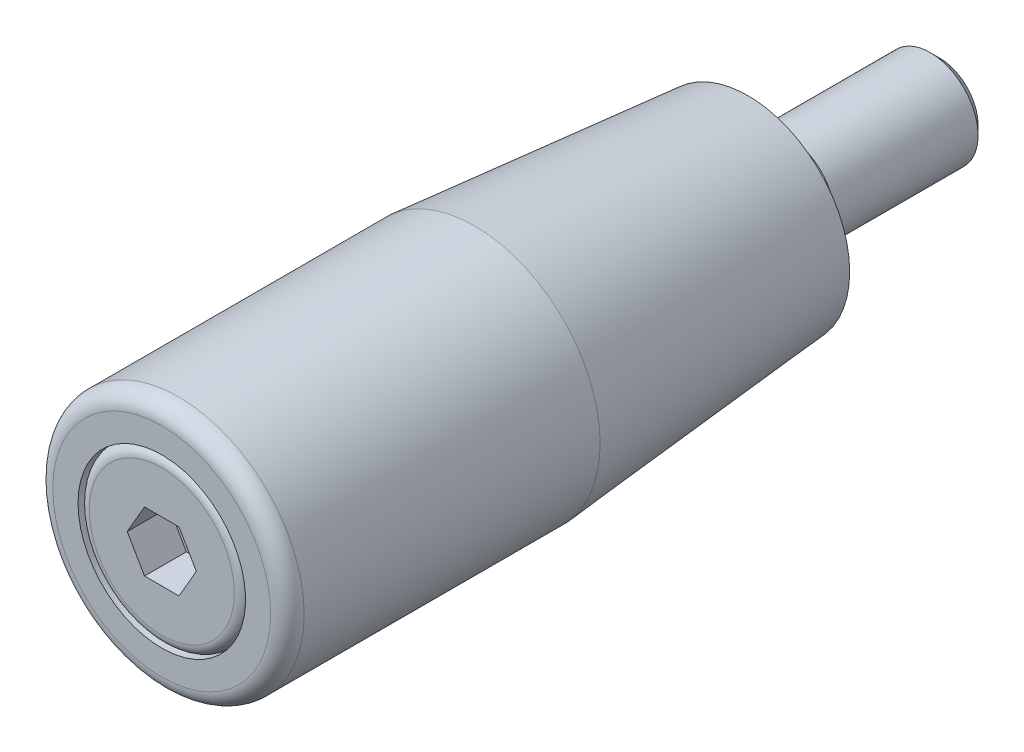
ISO-10303-21;
HEADER;
FILE_DESCRIPTION(('STEP AP214'),'2;1');
FILE_NAME('part.step','',(''),(''),'','','');
FILE_SCHEMA(('AUTOMOTIVE_DESIGN { 1 0 10303 214 1 1 1 1 }'));
ENDSEC;
DATA;
#1=APPLICATION_CONTEXT('core data for automotive mechanical design processes');
#2=APPLICATION_PROTOCOL_DEFINITION('international standard','automotive_design',2000,#1);
#3=PRODUCT_CONTEXT('',#1,'mechanical');
#4=PRODUCT('Part','Part','',(#3));
#5=PRODUCT_RELATED_PRODUCT_CATEGORY('part','',(#4));
#6=PRODUCT_DEFINITION_FORMATION('','',#4);
#7=PRODUCT_DEFINITION_CONTEXT('part definition',#1,'design');
#8=PRODUCT_DEFINITION('design','',#6,#7);
#9=PRODUCT_DEFINITION_SHAPE('','',#8);
#10=(LENGTH_UNIT() NAMED_UNIT(*) SI_UNIT(.MILLI.,.METRE.));
#11=(NAMED_UNIT(*) PLANE_ANGLE_UNIT() SI_UNIT($,.RADIAN.));
#12=(NAMED_UNIT(*) SI_UNIT($,.STERADIAN.) SOLID_ANGLE_UNIT());
#13=UNCERTAINTY_MEASURE_WITH_UNIT(LENGTH_MEASURE(1.E-05),#10,'distance_accuracy_value','');
#14=(GEOMETRIC_REPRESENTATION_CONTEXT(3) GLOBAL_UNCERTAINTY_ASSIGNED_CONTEXT((#13)) GLOBAL_UNIT_ASSIGNED_CONTEXT((#10,
#11,#12)) REPRESENTATION_CONTEXT('',''));
#15=CARTESIAN_POINT('',(0.,0.,0.));
#16=DIRECTION('',(0.,0.,1.));
#17=DIRECTION('',(1.,0.,0.));
#18=AXIS2_PLACEMENT_3D('',#15,#16,#17);
#19=CARTESIAN_POINT('',(0.,-3.49148133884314E-13,50.));
#20=DIRECTION('',(0.,0.,1.));
#21=DIRECTION('',(-1.,0.,0.));
#22=AXIS2_PLACEMENT_3D('',#19,#20,#21);
#23=CYLINDRICAL_SURFACE('',#22,5.);
#24=CARTESIAN_POINT('',(0.,0.,1.));
#25=DIRECTION('',(0.,0.,-1.));
#26=DIRECTION('',(1.,0.,0.));
#27=AXIS2_PLACEMENT_3D('',#24,#25,#26);
#28=CIRCLE('',#27,5.);
#29=CARTESIAN_POINT('',(5.,0.,1.));
#30=VERTEX_POINT('',#29);
#31=EDGE_CURVE('E9',#30,#30,#28,.F.);
#32=ORIENTED_EDGE('',*,*,#31,.F.);
#33=EDGE_LOOP('',(#32));
#34=FACE_BOUND('',#33,.T.);
#35=CARTESIAN_POINT('',(0.,0.,0.));
#36=DIRECTION('',(0.,0.,1.));
#37=DIRECTION('',(-1.,0.,0.));
#38=AXIS2_PLACEMENT_3D('',#35,#36,#37);
#39=CIRCLE('',#38,5.);
#40=CARTESIAN_POINT('',(-5.,0.,0.));
#41=VERTEX_POINT('',#40);
#42=EDGE_CURVE('E114',#41,#41,#39,.T.);
#43=ORIENTED_EDGE('',*,*,#42,.T.);
#44=EDGE_LOOP('',(#43));
#45=FACE_BOUND('',#44,.T.);
#46=ADVANCED_FACE('F15',(#34,#45),#23,.T.);
#47=CARTESIAN_POINT('',(0.,-3.,0.));
#48=DIRECTION('',(0.,0.,1.));
#49=DIRECTION('',(-1.,0.,0.));
#50=AXIS2_PLACEMENT_3D('',#47,#48,#49);
#51=PLANE('',#50);
#52=ORIENTED_EDGE('',*,*,#42,.F.);
#53=EDGE_LOOP('',(#52));
#54=FACE_BOUND('',#53,.T.);
#55=CARTESIAN_POINT('',(0.,0.,0.));
#56=DIRECTION('',(0.,0.,1.));
#57=DIRECTION('',(-1.,0.,0.));
#58=AXIS2_PLACEMENT_3D('',#55,#56,#57);
#59=CIRCLE('',#58,3.);
#60=CARTESIAN_POINT('',(-3.,0.,0.));
#61=VERTEX_POINT('',#60);
#62=EDGE_CURVE('E117',#61,#61,#59,.T.);
#63=ORIENTED_EDGE('',*,*,#62,.T.);
#64=EDGE_LOOP('',(#63));
#65=FACE_BOUND('',#64,.T.);
#66=ADVANCED_FACE('F216',(#54,#65),#51,.F.);
#67=CARTESIAN_POINT('',(0.,-3.49148133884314E-13,50.));
#68=DIRECTION('',(0.,0.,1.));
#69=DIRECTION('',(-1.,0.,0.));
#70=AXIS2_PLACEMENT_3D('',#67,#68,#69);
#71=CYLINDRICAL_SURFACE('',#70,3.);
#72=ORIENTED_EDGE('',*,*,#62,.F.);
#73=EDGE_LOOP('',(#72));
#74=FACE_BOUND('',#73,.T.);
#75=CARTESIAN_POINT('',(0.,0.,-1.5));
#76=DIRECTION('',(0.,0.,1.));
#77=DIRECTION('',(-1.,0.,0.));
#78=AXIS2_PLACEMENT_3D('',#75,#76,#77);
#79=CIRCLE('',#78,3.);
#80=CARTESIAN_POINT('',(-3.,0.,-1.5));
#81=VERTEX_POINT('',#80);
#82=EDGE_CURVE('E120',#81,#81,#79,.T.);
#83=ORIENTED_EDGE('',*,*,#82,.T.);
#84=EDGE_LOOP('',(#83));
#85=FACE_BOUND('',#84,.T.);
#86=ADVANCED_FACE('F417',(#74,#85),#71,.T.);
#87=CARTESIAN_POINT('',(0.,-3.233,-1.5));
#88=DIRECTION('',(0.,0.,-1.));
#89=DIRECTION('',(1.,0.,0.));
#90=AXIS2_PLACEMENT_3D('',#87,#88,#89);
#91=PLANE('',#90);
#92=ORIENTED_EDGE('',*,*,#82,.F.);
#93=EDGE_LOOP('',(#92));
#94=FACE_BOUND('',#93,.T.);
#95=CARTESIAN_POINT('',(0.,0.,-1.5));
#96=DIRECTION('',(0.,0.,1.));
#97=DIRECTION('',(-1.,0.,0.));
#98=AXIS2_PLACEMENT_3D('',#95,#96,#97);
#99=CIRCLE('',#98,3.233);
#100=CARTESIAN_POINT('',(-3.233,0.,-1.5));
#101=VERTEX_POINT('',#100);
#102=EDGE_CURVE('E123',#101,#101,#99,.T.);
#103=ORIENTED_EDGE('',*,*,#102,.T.);
#104=EDGE_LOOP('',(#103));
#105=FACE_BOUND('',#104,.T.);
#106=ADVANCED_FACE('F408',(#94,#105),#91,.F.);
#107=CARTESIAN_POINT('',(0.,0.,-2.267));
#108=DIRECTION('',(0.,0.,-1.));
#109=DIRECTION('',(1.,0.,0.));
#110=AXIS2_PLACEMENT_3D('',#107,#108,#109);
#111=CONICAL_SURFACE('',#110,4.,0.78539816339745);
#112=ORIENTED_EDGE('',*,*,#102,.F.);
#113=EDGE_LOOP('',(#112));
#114=FACE_BOUND('',#113,.T.);
#115=CARTESIAN_POINT('',(0.,0.,-2.267));
#116=DIRECTION('',(0.,0.,1.));
#117=DIRECTION('',(-1.,0.,0.));
#118=AXIS2_PLACEMENT_3D('',#115,#116,#117);
#119=CIRCLE('',#118,4.);
#120=CARTESIAN_POINT('',(-4.,0.,-2.267));
#121=VERTEX_POINT('',#120);
#122=EDGE_CURVE('E126',#121,#121,#119,.T.);
#123=ORIENTED_EDGE('',*,*,#122,.T.);
#124=EDGE_LOOP('',(#123));
#125=FACE_BOUND('',#124,.T.);
#126=ADVANCED_FACE('F399',(#114,#125),#111,.T.);
#127=CARTESIAN_POINT('',(0.,-3.49148133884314E-13,50.));
#128=DIRECTION('',(0.,0.,1.));
#129=DIRECTION('',(-1.,0.,0.));
#130=AXIS2_PLACEMENT_3D('',#127,#128,#129);
#131=CYLINDRICAL_SURFACE('',#130,4.);
#132=ORIENTED_EDGE('',*,*,#122,.F.);
#133=EDGE_LOOP('',(#132));
#134=FACE_BOUND('',#133,.T.);
#135=CARTESIAN_POINT('',(0.,0.,-14.233));
#136=DIRECTION('',(0.,0.,1.));
#137=DIRECTION('',(-1.,0.,0.));
#138=AXIS2_PLACEMENT_3D('',#135,#136,#137);
#139=CIRCLE('',#138,4.);
#140=CARTESIAN_POINT('',(-4.,0.,-14.233));
#141=VERTEX_POINT('',#140);
#142=EDGE_CURVE('E129',#141,#141,#139,.T.);
#143=ORIENTED_EDGE('',*,*,#142,.T.);
#144=EDGE_LOOP('',(#143));
#145=FACE_BOUND('',#144,.T.);
#146=ADVANCED_FACE('F392',(#134,#145),#131,.T.);
#147=CARTESIAN_POINT('',(0.,1.04744440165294E-13,-15.));
#148=DIRECTION('',(0.,0.,1.));
#149=DIRECTION('',(-1.,0.,0.));
#150=AXIS2_PLACEMENT_3D('',#147,#148,#149);
#151=CONICAL_SURFACE('',#150,3.233,0.785398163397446);
#152=ORIENTED_EDGE('',*,*,#142,.F.);
#153=EDGE_LOOP('',(#152));
#154=FACE_BOUND('',#153,.T.);
#155=CARTESIAN_POINT('',(0.,1.04744440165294E-13,-15.));
#156=DIRECTION('',(0.,0.,1.));
#157=DIRECTION('',(-1.,0.,0.));
#158=AXIS2_PLACEMENT_3D('',#155,#156,#157);
#159=CIRCLE('',#158,3.233);
#160=CARTESIAN_POINT('',(-3.233,1.04744440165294E-13,-15.));
#161=VERTEX_POINT('',#160);
#162=EDGE_CURVE('E132',#161,#161,#159,.T.);
#163=ORIENTED_EDGE('',*,*,#162,.T.);
#164=EDGE_LOOP('',(#163));
#165=FACE_BOUND('',#164,.T.);
#166=ADVANCED_FACE('F245',(#154,#165),#151,.T.);
#167=CARTESIAN_POINT('',(0.,1.04744440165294E-13,-15.));
#168=DIRECTION('',(0.,0.,1.));
#169=DIRECTION('',(-1.,0.,0.));
#170=AXIS2_PLACEMENT_3D('',#167,#168,#169);
#171=PLANE('',#170);
#172=ORIENTED_EDGE('',*,*,#162,.F.);
#173=EDGE_LOOP('',(#172));
#174=FACE_BOUND('',#173,.T.);
#175=ADVANCED_FACE('F17',(#174),#171,.F.);
#176=CARTESIAN_POINT('',(0.,-3.42630702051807E-13,49.0666666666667));
#177=DIRECTION('',(0.,0.,1.));
#178=DIRECTION('',(-1.,0.,0.));
#179=AXIS2_PLACEMENT_3D('',#176,#177,#178);
#180=TOROIDAL_SURFACE('',#179,6.06666666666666,0.933333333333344);
#181=CARTESIAN_POINT('',(0.,-3.42630702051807E-13,49.0666666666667));
#182=DIRECTION('',(0.,0.,1.));
#183=DIRECTION('',(-1.,0.,0.));
#184=AXIS2_PLACEMENT_3D('',#181,#182,#183);
#185=CIRCLE('',#184,7.);
#186=CARTESIAN_POINT('',(-7.,-3.42630702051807E-13,49.0666666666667));
#187=VERTEX_POINT('',#186);
#188=EDGE_CURVE('E166',#187,#187,#185,.F.);
#189=ORIENTED_EDGE('',*,*,#188,.F.);
#190=EDGE_LOOP('',(#189));
#191=FACE_BOUND('',#190,.T.);
#192=CARTESIAN_POINT('',(0.,-3.49148133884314E-13,50.));
#193=DIRECTION('',(0.,0.,1.));
#194=DIRECTION('',(-1.,0.,0.));
#195=AXIS2_PLACEMENT_3D('',#192,#193,#194);
#196=CIRCLE('',#195,6.06666666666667);
#197=CARTESIAN_POINT('',(-6.06666666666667,-3.49148133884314E-13,50.));
#198=VERTEX_POINT('',#197);
#199=EDGE_CURVE('E83',#198,#198,#196,.T.);
#200=ORIENTED_EDGE('',*,*,#199,.F.);
#201=EDGE_LOOP('',(#200));
#202=FACE_BOUND('',#201,.T.);
#203=ADVANCED_FACE('F236',(#191,#202),#180,.T.);
#204=CARTESIAN_POINT('',(0.,-6.06666666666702,50.));
#205=DIRECTION('',(0.,0.,-1.));
#206=DIRECTION('',(1.,0.,0.));
#207=AXIS2_PLACEMENT_3D('',#204,#205,#206);
#208=PLANE('',#207);
#209=DIRECTION('',(1.,0.,0.));
#210=VECTOR('',#209,1.);
#211=CARTESIAN_POINT('',(0.,-2.50000000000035,50.));
#212=LINE('',#211,#210);
#213=CARTESIAN_POINT('',(-1.44337567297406,-2.50000000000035,50.));
#214=VERTEX_POINT('',#213);
#215=CARTESIAN_POINT('',(1.44337567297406,-2.50000000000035,50.));
#216=VERTEX_POINT('',#215);
#217=EDGE_CURVE('E139',#214,#216,#212,.T.);
#218=ORIENTED_EDGE('',*,*,#217,.F.);
#219=DIRECTION('',(0.5,-0.866025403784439,0.));
#220=VECTOR('',#219,1.);
#221=CARTESIAN_POINT('',(0.4618802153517,-5.80000000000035,50.));
#222=LINE('',#221,#220);
#223=CARTESIAN_POINT('',(-2.88675134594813,-3.49148133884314E-13,50.));
#224=VERTEX_POINT('',#223);
#225=EDGE_CURVE('E141',#224,#214,#222,.T.);
#226=ORIENTED_EDGE('',*,*,#225,.F.);
#227=DIRECTION('',(-0.5,-0.866025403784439,0.));
#228=VECTOR('',#227,1.);
#229=CARTESIAN_POINT('',(-4.79200723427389,-3.30000000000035,50.));
#230=LINE('',#229,#228);
#231=CARTESIAN_POINT('',(-1.44337567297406,2.49999999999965,50.));
#232=VERTEX_POINT('',#231);
#233=EDGE_CURVE('E144',#232,#224,#230,.T.);
#234=ORIENTED_EDGE('',*,*,#233,.F.);
#235=DIRECTION('',(-1.,0.,0.));
#236=VECTOR('',#235,1.);
#237=CARTESIAN_POINT('',(0.,2.49999999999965,50.));
#238=LINE('',#237,#236);
#239=CARTESIAN_POINT('',(1.44337567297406,2.49999999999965,50.));
#240=VERTEX_POINT('',#239);
#241=EDGE_CURVE('E39',#240,#232,#238,.T.);
#242=ORIENTED_EDGE('',*,*,#241,.F.);
#243=DIRECTION('',(-0.5,0.866025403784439,0.));
#244=VECTOR('',#243,1.);
#245=CARTESIAN_POINT('',(4.79200723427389,-3.30000000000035,50.));
#246=LINE('',#245,#244);
#247=CARTESIAN_POINT('',(2.88675134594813,-3.49148133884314E-13,50.));
#248=VERTEX_POINT('',#247);
#249=EDGE_CURVE('E135',#248,#240,#246,.T.);
#250=ORIENTED_EDGE('',*,*,#249,.F.);
#251=DIRECTION('',(0.5,0.866025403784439,0.));
#252=VECTOR('',#251,1.);
#253=CARTESIAN_POINT('',(-0.4618802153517,-5.80000000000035,50.));
#254=LINE('',#253,#252);
#255=EDGE_CURVE('E137',#216,#248,#254,.T.);
#256=ORIENTED_EDGE('',*,*,#255,.F.);
#257=EDGE_LOOP('',(#218,#226,#234,#242,#250,#256));
#258=FACE_BOUND('',#257,.T.);
#259=ORIENTED_EDGE('',*,*,#199,.T.);
#260=EDGE_LOOP('',(#259));
#261=FACE_BOUND('',#260,.T.);
#262=ADVANCED_FACE('F227',(#258,#261),#208,.F.);
#263=CARTESIAN_POINT('',(-1.44337567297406,-2.50000000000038,53.5));
#264=DIRECTION('',(0.,1.,0.));
#265=DIRECTION('',(-1.,0.,0.));
#266=AXIS2_PLACEMENT_3D('',#263,#264,#265);
#267=PLANE('',#266);
#268=DIRECTION('',(0.,0.,-1.));
#269=VECTOR('',#268,1.);
#270=CARTESIAN_POINT('',(-1.44337567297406,-2.50000000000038,53.5));
#271=LINE('',#270,#269);
#272=CARTESIAN_POINT('',(-1.44337567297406,-2.50000000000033,46.5));
#273=VERTEX_POINT('',#272);
#274=EDGE_CURVE('E105',#214,#273,#271,.T.);
#275=ORIENTED_EDGE('',*,*,#274,.F.);
#276=ORIENTED_EDGE('',*,*,#217,.T.);
#277=DIRECTION('',(0.,0.,-1.));
#278=VECTOR('',#277,1.);
#279=CARTESIAN_POINT('',(1.44337567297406,-2.50000000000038,53.5));
#280=LINE('',#279,#278);
#281=CARTESIAN_POINT('',(1.44337567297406,-2.50000000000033,46.5));
#282=VERTEX_POINT('',#281);
#283=EDGE_CURVE('E102',#216,#282,#280,.T.);
#284=ORIENTED_EDGE('',*,*,#283,.T.);
#285=DIRECTION('',(1.,0.,0.));
#286=VECTOR('',#285,1.);
#287=CARTESIAN_POINT('',(-1.44337567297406,-2.50000000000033,46.5));
#288=LINE('',#287,#286);
#289=EDGE_CURVE('E91',#273,#282,#288,.T.);
#290=ORIENTED_EDGE('',*,*,#289,.F.);
#291=EDGE_LOOP('',(#275,#276,#284,#290));
#292=FACE_BOUND('',#291,.T.);
#293=ADVANCED_FACE('F223',(#292),#267,.T.);
#294=CARTESIAN_POINT('',(-2.88675134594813,-3.73588503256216E-13,53.5));
#295=DIRECTION('',(0.866025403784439,0.5,0.));
#296=DIRECTION('',(-0.5,0.866025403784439,0.));
#297=AXIS2_PLACEMENT_3D('',#294,#295,#296);
#298=PLANE('',#297);
#299=ORIENTED_EDGE('',*,*,#225,.T.);
#300=ORIENTED_EDGE('',*,*,#274,.T.);
#301=DIRECTION('',(0.5,-0.866025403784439,0.));
#302=VECTOR('',#301,1.);
#303=CARTESIAN_POINT('',(-2.88675134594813,-3.24707764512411E-13,46.5));
#304=LINE('',#303,#302);
#305=CARTESIAN_POINT('',(-2.88675134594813,-3.24707764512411E-13,46.5));
#306=VERTEX_POINT('',#305);
#307=EDGE_CURVE('E89',#306,#273,#304,.T.);
#308=ORIENTED_EDGE('',*,*,#307,.F.);
#309=DIRECTION('',(0.,0.,-1.));
#310=VECTOR('',#309,1.);
#311=CARTESIAN_POINT('',(-2.88675134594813,-3.73588503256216E-13,53.5));
#312=LINE('',#311,#310);
#313=EDGE_CURVE('E84',#224,#306,#312,.T.);
#314=ORIENTED_EDGE('',*,*,#313,.F.);
#315=EDGE_LOOP('',(#299,#300,#308,#314));
#316=FACE_BOUND('',#315,.T.);
#317=ADVANCED_FACE('F226',(#316),#298,.T.);
#318=CARTESIAN_POINT('',(-1.44337567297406,2.49999999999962,53.5));
#319=DIRECTION('',(0.866025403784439,-0.5,0.));
#320=DIRECTION('',(0.5,0.866025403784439,0.));
#321=AXIS2_PLACEMENT_3D('',#318,#319,#320);
#322=PLANE('',#321);
#323=ORIENTED_EDGE('',*,*,#233,.T.);
#324=ORIENTED_EDGE('',*,*,#313,.T.);
#325=DIRECTION('',(-0.5,-0.866025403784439,0.));
#326=VECTOR('',#325,1.);
#327=CARTESIAN_POINT('',(-1.44337567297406,2.49999999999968,46.5));
#328=LINE('',#327,#326);
#329=CARTESIAN_POINT('',(-1.44337567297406,2.49999999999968,46.5));
#330=VERTEX_POINT('',#329);
#331=EDGE_CURVE('E74',#330,#306,#328,.T.);
#332=ORIENTED_EDGE('',*,*,#331,.F.);
#333=DIRECTION('',(0.,0.,-1.));
#334=VECTOR('',#333,1.);
#335=CARTESIAN_POINT('',(-1.44337567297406,2.49999999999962,53.5));
#336=LINE('',#335,#334);
#337=EDGE_CURVE('E79',#232,#330,#336,.T.);
#338=ORIENTED_EDGE('',*,*,#337,.F.);
#339=EDGE_LOOP('',(#323,#324,#332,#338));
#340=FACE_BOUND('',#339,.T.);
#341=ADVANCED_FACE('F86',(#340),#322,.T.);
#342=CARTESIAN_POINT('',(1.44337567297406,2.49999999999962,53.5));
#343=DIRECTION('',(0.,-1.,0.));
#344=DIRECTION('',(1.,0.,0.));
#345=AXIS2_PLACEMENT_3D('',#342,#343,#344);
#346=PLANE('',#345);
#347=ORIENTED_EDGE('',*,*,#241,.T.);
#348=ORIENTED_EDGE('',*,*,#337,.T.);
#349=DIRECTION('',(-1.,0.,0.));
#350=VECTOR('',#349,1.);
#351=CARTESIAN_POINT('',(1.44337567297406,2.49999999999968,46.5));
#352=LINE('',#351,#350);
#353=CARTESIAN_POINT('',(1.44337567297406,2.49999999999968,46.5));
#354=VERTEX_POINT('',#353);
#355=EDGE_CURVE('E71',#354,#330,#352,.T.);
#356=ORIENTED_EDGE('',*,*,#355,.F.);
#357=DIRECTION('',(0.,0.,-1.));
#358=VECTOR('',#357,1.);
#359=CARTESIAN_POINT('',(1.44337567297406,2.49999999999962,53.5));
#360=LINE('',#359,#358);
#361=EDGE_CURVE('E99',#240,#354,#360,.T.);
#362=ORIENTED_EDGE('',*,*,#361,.F.);
#363=EDGE_LOOP('',(#347,#348,#356,#362));
#364=FACE_BOUND('',#363,.T.);
#365=ADVANCED_FACE('F80',(#364),#346,.T.);
#366=CARTESIAN_POINT('',(2.88675134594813,-3.73588503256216E-13,53.5));
#367=DIRECTION('',(-0.866025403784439,-0.5,0.));
#368=DIRECTION('',(0.5,-0.866025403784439,0.));
#369=AXIS2_PLACEMENT_3D('',#366,#367,#368);
#370=PLANE('',#369);
#371=ORIENTED_EDGE('',*,*,#249,.T.);
#372=ORIENTED_EDGE('',*,*,#361,.T.);
#373=DIRECTION('',(-0.5,0.866025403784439,0.));
#374=VECTOR('',#373,1.);
#375=CARTESIAN_POINT('',(2.88675134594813,-3.24707764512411E-13,46.5));
#376=LINE('',#375,#374);
#377=CARTESIAN_POINT('',(2.88675134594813,-3.24707764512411E-13,46.5));
#378=VERTEX_POINT('',#377);
#379=EDGE_CURVE('E76',#378,#354,#376,.T.);
#380=ORIENTED_EDGE('',*,*,#379,.F.);
#381=DIRECTION('',(0.,0.,-1.));
#382=VECTOR('',#381,1.);
#383=CARTESIAN_POINT('',(2.88675134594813,-3.73588503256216E-13,53.5));
#384=LINE('',#383,#382);
#385=EDGE_CURVE('E31',#248,#378,#384,.T.);
#386=ORIENTED_EDGE('',*,*,#385,.F.);
#387=EDGE_LOOP('',(#371,#372,#380,#386));
#388=FACE_BOUND('',#387,.T.);
#389=ADVANCED_FACE('F217',(#388),#370,.T.);
#390=CARTESIAN_POINT('',(1.44337567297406,-2.50000000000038,53.5));
#391=DIRECTION('',(-0.866025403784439,0.5,0.));
#392=DIRECTION('',(-0.5,-0.866025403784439,0.));
#393=AXIS2_PLACEMENT_3D('',#390,#391,#392);
#394=PLANE('',#393);
#395=ORIENTED_EDGE('',*,*,#255,.T.);
#396=ORIENTED_EDGE('',*,*,#385,.T.);
#397=DIRECTION('',(0.5,0.866025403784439,0.));
#398=VECTOR('',#397,1.);
#399=CARTESIAN_POINT('',(1.44337567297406,-2.50000000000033,46.5));
#400=LINE('',#399,#398);
#401=EDGE_CURVE('E96',#282,#378,#400,.T.);
#402=ORIENTED_EDGE('',*,*,#401,.F.);
#403=ORIENTED_EDGE('',*,*,#283,.F.);
#404=EDGE_LOOP('',(#395,#396,#402,#403));
#405=FACE_BOUND('',#404,.T.);
#406=ADVANCED_FACE('F215',(#405),#394,.T.);
#407=CARTESIAN_POINT('',(0.,-3.24707764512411E-13,46.5));
#408=DIRECTION('',(0.,0.,1.));
#409=DIRECTION('',(-1.,0.,0.));
#410=AXIS2_PLACEMENT_3D('',#407,#408,#409);
#411=PLANE('',#410);
#412=ORIENTED_EDGE('',*,*,#307,.T.);
#413=ORIENTED_EDGE('',*,*,#289,.T.);
#414=ORIENTED_EDGE('',*,*,#401,.T.);
#415=ORIENTED_EDGE('',*,*,#379,.T.);
#416=ORIENTED_EDGE('',*,*,#355,.T.);
#417=ORIENTED_EDGE('',*,*,#331,.T.);
#418=EDGE_LOOP('',(#412,#413,#414,#415,#416,#417));
#419=FACE_BOUND('',#418,.T.);
#420=ADVANCED_FACE('F72',(#419),#411,.T.);
#421=CARTESIAN_POINT('',(0.,-3.49148133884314E-13,50.));
#422=DIRECTION('',(0.,0.,1.));
#423=DIRECTION('',(-1.,0.,0.));
#424=AXIS2_PLACEMENT_3D('',#421,#422,#423);
#425=CYLINDRICAL_SURFACE('',#424,7.);
#426=CARTESIAN_POINT('',(0.,-3.49148133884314E-13,50.));
#427=DIRECTION('',(0.,0.,1.));
#428=DIRECTION('',(-1.,0.,0.));
#429=AXIS2_PLACEMENT_3D('',#426,#427,#428);
#430=CIRCLE('',#429,7.);
#431=CARTESIAN_POINT('',(-7.,-3.49148133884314E-13,50.));
#432=VERTEX_POINT('',#431);
#433=EDGE_CURVE('E160',#432,#432,#430,.T.);
#434=ORIENTED_EDGE('',*,*,#433,.T.);
#435=EDGE_LOOP('',(#434));
#436=FACE_BOUND('',#435,.T.);
#437=ORIENTED_EDGE('',*,*,#188,.T.);
#438=EDGE_LOOP('',(#437));
#439=FACE_BOUND('',#438,.T.);
#440=ADVANCED_FACE('F204',(#436,#439),#425,.F.);
#441=CARTESIAN_POINT('',(0.,-7.00000000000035,50.));
#442=DIRECTION('',(0.,0.,1.));
#443=DIRECTION('',(-1.,0.,0.));
#444=AXIS2_PLACEMENT_3D('',#441,#442,#443);
#445=PLANE('',#444);
#446=CARTESIAN_POINT('',(0.,-3.49148133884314E-13,50.));
#447=DIRECTION('',(0.,0.,1.));
#448=DIRECTION('',(-1.,0.,0.));
#449=AXIS2_PLACEMENT_3D('',#446,#447,#448);
#450=CIRCLE('',#449,9.1);
#451=CARTESIAN_POINT('',(-9.1,-3.49148133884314E-13,50.));
#452=VERTEX_POINT('',#451);
#453=EDGE_CURVE('E157',#452,#452,#450,.T.);
#454=ORIENTED_EDGE('',*,*,#453,.T.);
#455=EDGE_LOOP('',(#454));
#456=FACE_BOUND('',#455,.T.);
#457=ORIENTED_EDGE('',*,*,#433,.F.);
#458=EDGE_LOOP('',(#457));
#459=FACE_BOUND('',#458,.T.);
#460=ADVANCED_FACE('F260',(#456,#459),#445,.T.);
#461=CARTESIAN_POINT('',(0.,-3.39371986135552E-13,48.6));
#462=DIRECTION('',(0.,0.,1.));
#463=DIRECTION('',(-1.,0.,0.));
#464=AXIS2_PLACEMENT_3D('',#461,#462,#463);
#465=TOROIDAL_SURFACE('',#464,9.1,1.40000000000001);
#466=CARTESIAN_POINT('',(0.,-3.39371986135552E-13,48.6));
#467=DIRECTION('',(0.,0.,1.));
#468=DIRECTION('',(-1.,0.,0.));
#469=AXIS2_PLACEMENT_3D('',#466,#467,#468);
#470=CIRCLE('',#469,10.5);
#471=CARTESIAN_POINT('',(-10.5,-3.39371986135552E-13,48.6));
#472=VERTEX_POINT('',#471);
#473=EDGE_CURVE('E152',#472,#472,#470,.T.);
#474=ORIENTED_EDGE('',*,*,#473,.T.);
#475=EDGE_LOOP('',(#474));
#476=FACE_BOUND('',#475,.T.);
#477=ORIENTED_EDGE('',*,*,#453,.F.);
#478=EDGE_LOOP('',(#477));
#479=FACE_BOUND('',#478,.T.);
#480=ADVANCED_FACE('F211',(#476,#479),#465,.T.);
#481=CARTESIAN_POINT('',(0.,-8.5,0.999999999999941));
#482=DIRECTION('',(0.,0.,-1.));
#483=DIRECTION('',(1.,0.,0.));
#484=AXIS2_PLACEMENT_3D('',#481,#482,#483);
#485=PLANE('',#484);
#486=ORIENTED_EDGE('',*,*,#31,.T.);
#487=EDGE_LOOP('',(#486));
#488=FACE_BOUND('',#487,.T.);
#489=CARTESIAN_POINT('',(0.,0.,1.));
#490=DIRECTION('',(0.,0.,1.));
#491=DIRECTION('',(-1.,0.,0.));
#492=AXIS2_PLACEMENT_3D('',#489,#490,#491);
#493=CIRCLE('',#492,8.5);
#494=CARTESIAN_POINT('',(-8.5,0.,1.));
#495=VERTEX_POINT('',#494);
#496=EDGE_CURVE('E145',#495,#495,#493,.T.);
#497=ORIENTED_EDGE('',*,*,#496,.F.);
#498=EDGE_LOOP('',(#497));
#499=FACE_BOUND('',#498,.T.);
#500=ADVANCED_FACE('F207',(#488,#499),#485,.T.);
#501=CARTESIAN_POINT('',(0.,-1.66614219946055E-13,23.8601046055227));
#502=DIRECTION('',(0.,0.,1.));
#503=DIRECTION('',(-1.,0.,0.));
#504=AXIS2_PLACEMENT_3D('',#501,#502,#503);
#505=CONICAL_SURFACE('',#504,10.5,0.0872664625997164);
#506=ORIENTED_EDGE('',*,*,#496,.T.);
#507=EDGE_LOOP('',(#506));
#508=FACE_BOUND('',#507,.T.);
#509=CARTESIAN_POINT('',(0.,-1.66614219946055E-13,23.8601046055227));
#510=DIRECTION('',(0.,0.,1.));
#511=DIRECTION('',(-1.,0.,0.));
#512=AXIS2_PLACEMENT_3D('',#509,#510,#511);
#513=CIRCLE('',#512,10.5);
#514=CARTESIAN_POINT('',(-10.5,-1.66614219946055E-13,23.8601046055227));
#515=VERTEX_POINT('',#514);
#516=EDGE_CURVE('E147',#515,#515,#513,.T.);
#517=ORIENTED_EDGE('',*,*,#516,.F.);
#518=EDGE_LOOP('',(#517));
#519=FACE_BOUND('',#518,.T.);
#520=ADVANCED_FACE('F210',(#508,#519),#505,.T.);
#521=CARTESIAN_POINT('',(0.,-3.49148133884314E-13,50.));
#522=DIRECTION('',(0.,0.,1.));
#523=DIRECTION('',(-1.,0.,0.));
#524=AXIS2_PLACEMENT_3D('',#521,#522,#523);
#525=CYLINDRICAL_SURFACE('',#524,10.5);
#526=ORIENTED_EDGE('',*,*,#516,.T.);
#527=EDGE_LOOP('',(#526));
#528=FACE_BOUND('',#527,.T.);
#529=ORIENTED_EDGE('',*,*,#473,.F.);
#530=EDGE_LOOP('',(#529));
#531=FACE_BOUND('',#530,.T.);
#532=ADVANCED_FACE('F249',(#528,#531),#525,.T.);
#533=CLOSED_SHELL('',(#46,#66,#86,#106,#126,#146,#166,#175,#203,#262,#293,#317,#341,#365,#389,
#406,#420,#440,#460,#480,#500,#520,#532));
#534=CARTESIAN_POINT('',(0.,-5.00000000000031,44.));
#535=DIRECTION('',(0.,0.,1.));
#536=DIRECTION('',(-1.,0.,0.));
#537=AXIS2_PLACEMENT_3D('',#534,#535,#536);
#538=PLANE('',#537);
#539=CARTESIAN_POINT('',(0.,-3.07250357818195E-13,44.));
#540=DIRECTION('',(0.,0.,1.));
#541=DIRECTION('',(-1.,0.,0.));
#542=AXIS2_PLACEMENT_3D('',#539,#540,#541);
#543=CIRCLE('',#542,5.);
#544=CARTESIAN_POINT('',(-5.,-3.07250357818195E-13,44.));
#545=VERTEX_POINT('',#544);
#546=EDGE_CURVE('E24',#545,#545,#543,.F.);
#547=ORIENTED_EDGE('',*,*,#546,.T.);
#548=EDGE_LOOP('',(#547));
#549=FACE_BOUND('',#548,.T.);
#550=CARTESIAN_POINT('',(0.,-3.07250357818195E-13,44.));
#551=DIRECTION('',(0.,0.,1.));
#552=DIRECTION('',(-1.,0.,0.));
#553=AXIS2_PLACEMENT_3D('',#550,#551,#552);
#554=CIRCLE('',#553,7.);
#555=CARTESIAN_POINT('',(-7.,-3.07250357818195E-13,44.));
#556=VERTEX_POINT('',#555);
#557=EDGE_CURVE('E163',#556,#556,#554,.T.);
#558=ORIENTED_EDGE('',*,*,#557,.T.);
#559=EDGE_LOOP('',(#558));
#560=FACE_BOUND('',#559,.T.);
#561=ADVANCED_FACE('F174',(#549,#560),#538,.T.);
#562=ORIENTED_EDGE('',*,*,#557,.F.);
#563=EDGE_LOOP('',(#562));
#564=FACE_BOUND('',#563,.T.);
#565=CARTESIAN_POINT('',(0.,-3.16328209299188E-13,45.3));
#566=DIRECTION('',(0.,0.,1.));
#567=DIRECTION('',(-1.,0.,0.));
#568=AXIS2_PLACEMENT_3D('',#565,#566,#567);
#569=CIRCLE('',#568,7.);
#570=CARTESIAN_POINT('',(-7.,-3.16328209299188E-13,45.3));
#571=VERTEX_POINT('',#570);
#572=EDGE_CURVE('E169',#571,#571,#569,.T.);
#573=ORIENTED_EDGE('',*,*,#572,.T.);
#574=EDGE_LOOP('',(#573));
#575=FACE_BOUND('',#574,.T.);
#576=ADVANCED_FACE('F181',(#564,#575),#425,.F.);
#577=ORIENTED_EDGE('',*,*,#546,.F.);
#578=EDGE_LOOP('',(#577));
#579=FACE_BOUND('',#578,.T.);
#580=CARTESIAN_POINT('',(0.,-3.16328209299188E-13,45.3));
#581=DIRECTION('',(0.,0.,1.));
#582=DIRECTION('',(-1.,0.,0.));
#583=AXIS2_PLACEMENT_3D('',#580,#581,#582);
#584=CIRCLE('',#583,5.);
#585=CARTESIAN_POINT('',(-5.,-3.16328209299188E-13,45.3));
#586=VERTEX_POINT('',#585);
#587=EDGE_CURVE('E111',#586,#586,#584,.T.);
#588=ORIENTED_EDGE('',*,*,#587,.F.);
#589=EDGE_LOOP('',(#588));
#590=FACE_BOUND('',#589,.T.);
#591=ADVANCED_FACE('F177',(#579,#590),#23,.T.);
#592=CARTESIAN_POINT('',(0.,-5.00000000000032,45.3));
#593=DIRECTION('',(0.,0.,1.));
#594=DIRECTION('',(-1.,0.,0.));
#595=AXIS2_PLACEMENT_3D('',#592,#593,#594);
#596=PLANE('',#595);
#597=ORIENTED_EDGE('',*,*,#572,.F.);
#598=EDGE_LOOP('',(#597));
#599=FACE_BOUND('',#598,.T.);
#600=ORIENTED_EDGE('',*,*,#587,.T.);
#601=EDGE_LOOP('',(#600));
#602=FACE_BOUND('',#601,.T.);
#603=ADVANCED_FACE('F180',(#599,#602),#596,.F.);
#604=CLOSED_SHELL('',(#561,#576,#591,#603));
#605=ORIENTED_CLOSED_SHELL('',*,#604,.T.);
#606=BREP_WITH_VOIDS('B1',#533,(#605));
#607=ADVANCED_BREP_SHAPE_REPRESENTATION('',(#18,#606),#14);
#608=SHAPE_DEFINITION_REPRESENTATION(#9,#607);
ENDSEC;
END-ISO-10303-21;
